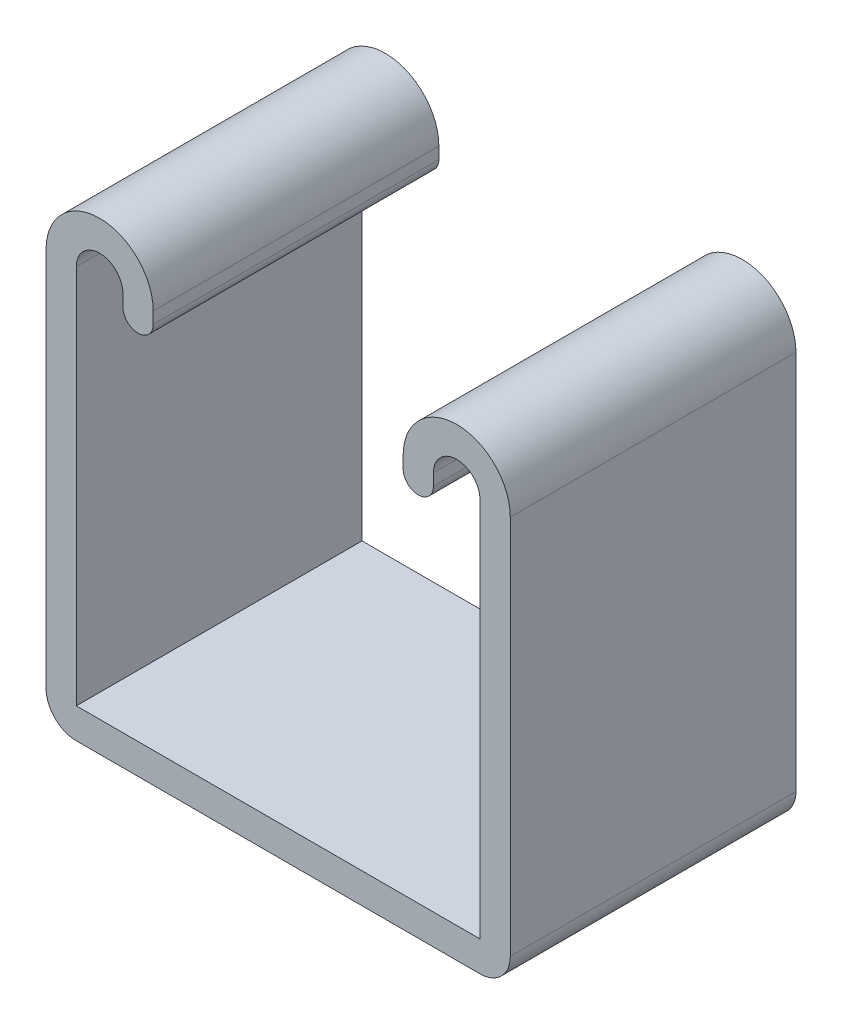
from build123d import *

# Parameters (mm, degrees)
BASE_EXTRUDE_DEPTH = 12.7


with BuildPart() as part:
    # Sketch1 → Base-Extrude (new, symmetric)
    with BuildSketch(Plane.XY):
        with BuildLine():
            Line((-20.6375, 18.4785), (-20.6375, -15.3416))
            ThreePointArc((-20.6375, -15.3416), (-19.848914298, -17.245414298), (-17.9451, -18.034))
            Line((-17.9451, -18.034), (17.9451, -18.034))
            ThreePointArc((17.9451, -18.034), (19.848914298, -17.245414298), (20.6375, -15.3416))
            Line((20.6375, -15.3416), (20.6375, 18.4785))
            ThreePointArc((20.6375, 18.4785), (15.875, 23.241), (11.1125, 18.4785))
            Line((11.1125, 18.4785), (11.1125, 17.44345))
            ThreePointArc((11.1125, 17.44345), (12.4587, 16.09725), (13.8049, 17.44345))
            Line((13.8049, 17.44345), (13.8049, 18.4785))
            ThreePointArc((13.8049, 18.4785), (15.875, 20.5486), (17.9451, 18.4785))
            Line((17.9451, 18.4785), (17.9451, -15.3416))
            Line((17.9451, -15.3416), (-17.9451, -15.3416))
            Line((-17.9451, -15.3416), (-17.9451, 18.4785))
            ThreePointArc((-17.9451, 18.4785), (-15.875, 20.5486), (-13.8049, 18.4785))
            Line((-13.8049, 18.4785), (-13.8049, 17.44345))
            ThreePointArc((-13.8049, 17.44345), (-12.4587, 16.09725), (-11.1125, 17.44345))
            Line((-11.1125, 17.44345), (-11.1125, 18.4785))
            ThreePointArc((-11.1125, 18.4785), (-15.875, 23.241), (-20.6375, 18.4785))
        make_face()
    extrude(amount=BASE_EXTRUDE_DEPTH, both=True)


solid = part.part
